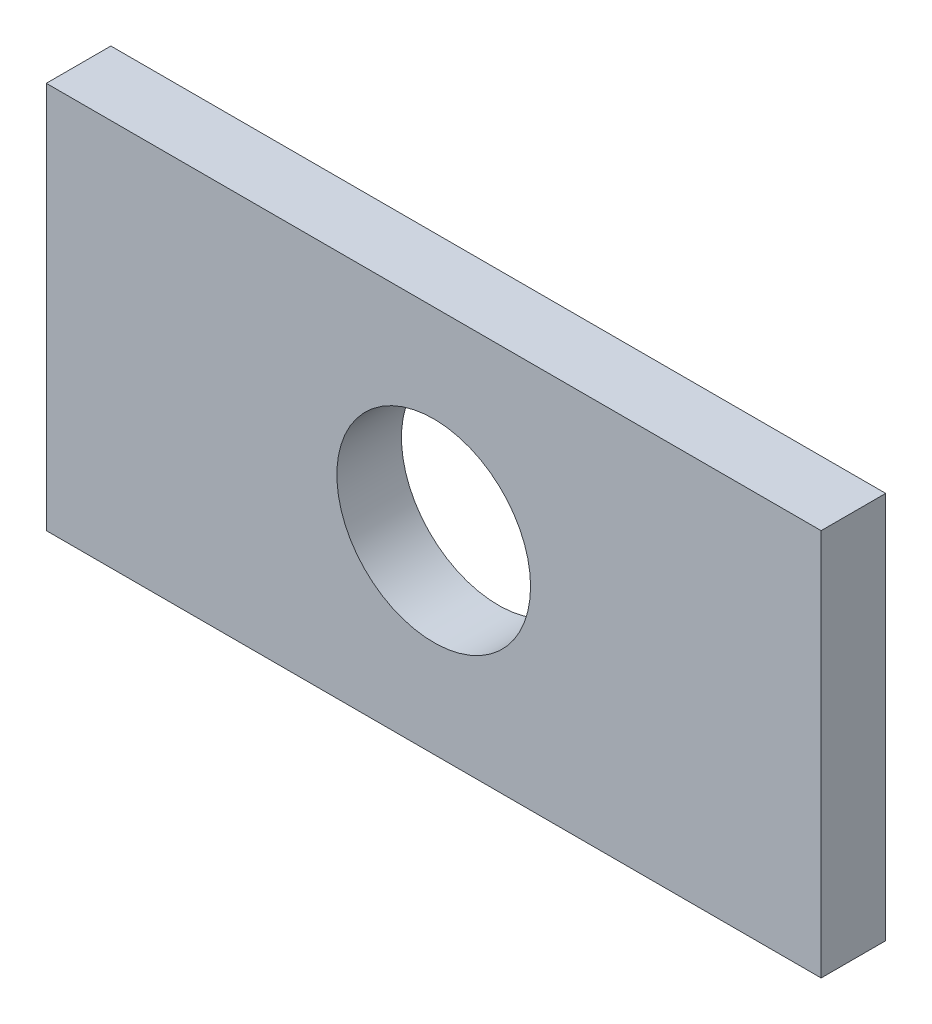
ISO-10303-21;
HEADER;
FILE_DESCRIPTION(('STEP AP214'),'2;1');
FILE_NAME('part.step','',(''),(''),'','','');
FILE_SCHEMA(('AUTOMOTIVE_DESIGN { 1 0 10303 214 1 1 1 1 }'));
ENDSEC;
DATA;
#1=APPLICATION_CONTEXT('core data for automotive mechanical design processes');
#2=APPLICATION_PROTOCOL_DEFINITION('international standard','automotive_design',2000,#1);
#3=PRODUCT_CONTEXT('',#1,'mechanical');
#4=PRODUCT('Part','Part','',(#3));
#5=PRODUCT_RELATED_PRODUCT_CATEGORY('part','',(#4));
#6=PRODUCT_DEFINITION_FORMATION('','',#4);
#7=PRODUCT_DEFINITION_CONTEXT('part definition',#1,'design');
#8=PRODUCT_DEFINITION('design','',#6,#7);
#9=PRODUCT_DEFINITION_SHAPE('','',#8);
#10=(LENGTH_UNIT() NAMED_UNIT(*) SI_UNIT(.MILLI.,.METRE.));
#11=(NAMED_UNIT(*) PLANE_ANGLE_UNIT() SI_UNIT($,.RADIAN.));
#12=(NAMED_UNIT(*) SI_UNIT($,.STERADIAN.) SOLID_ANGLE_UNIT());
#13=UNCERTAINTY_MEASURE_WITH_UNIT(LENGTH_MEASURE(1.E-05),#10,'distance_accuracy_value','');
#14=(GEOMETRIC_REPRESENTATION_CONTEXT(3) GLOBAL_UNCERTAINTY_ASSIGNED_CONTEXT((#13)) GLOBAL_UNIT_ASSIGNED_CONTEXT((#10,
#11,#12)) REPRESENTATION_CONTEXT('',''));
#15=CARTESIAN_POINT('',(0.,0.,0.));
#16=DIRECTION('',(0.,0.,1.));
#17=DIRECTION('',(1.,0.,0.));
#18=AXIS2_PLACEMENT_3D('',#15,#16,#17);
#19=CARTESIAN_POINT('',(-76.2,38.1,6.35));
#20=DIRECTION('',(1.,0.,0.));
#21=DIRECTION('',(0.,0.,-1.));
#22=AXIS2_PLACEMENT_3D('',#19,#20,#21);
#23=PLANE('',#22);
#24=DIRECTION('',(0.,-1.,0.));
#25=VECTOR('',#24,1.);
#26=CARTESIAN_POINT('',(-76.2,38.1,-6.35));
#27=LINE('',#26,#25);
#28=CARTESIAN_POINT('',(-76.2,38.1,-6.35));
#29=VERTEX_POINT('',#28);
#30=CARTESIAN_POINT('',(-76.2,-38.1,-6.35));
#31=VERTEX_POINT('',#30);
#32=EDGE_CURVE('E80',#29,#31,#27,.T.);
#33=ORIENTED_EDGE('',*,*,#32,.T.);
#34=DIRECTION('',(0.,0.,-1.));
#35=VECTOR('',#34,1.);
#36=CARTESIAN_POINT('',(-76.2,-38.1,6.35));
#37=LINE('',#36,#35);
#38=CARTESIAN_POINT('',(-76.2,-38.1,6.35));
#39=VERTEX_POINT('',#38);
#40=EDGE_CURVE('E11',#39,#31,#37,.T.);
#41=ORIENTED_EDGE('',*,*,#40,.F.);
#42=DIRECTION('',(0.,-1.,0.));
#43=VECTOR('',#42,1.);
#44=CARTESIAN_POINT('',(-76.2,38.1,6.35));
#45=LINE('',#44,#43);
#46=CARTESIAN_POINT('',(-76.2,38.1,6.35));
#47=VERTEX_POINT('',#46);
#48=EDGE_CURVE('E103',#47,#39,#45,.T.);
#49=ORIENTED_EDGE('',*,*,#48,.F.);
#50=DIRECTION('',(0.,0.,-1.));
#51=VECTOR('',#50,1.);
#52=CARTESIAN_POINT('',(-76.2,38.1,6.35));
#53=LINE('',#52,#51);
#54=EDGE_CURVE('E92',#47,#29,#53,.T.);
#55=ORIENTED_EDGE('',*,*,#54,.T.);
#56=EDGE_LOOP('',(#33,#41,#49,#55));
#57=FACE_BOUND('',#56,.T.);
#58=ADVANCED_FACE('F36',(#57),#23,.F.);
#59=CARTESIAN_POINT('',(-76.2,-38.1,6.35));
#60=DIRECTION('',(0.,1.,0.));
#61=DIRECTION('',(0.,0.,1.));
#62=AXIS2_PLACEMENT_3D('',#59,#60,#61);
#63=PLANE('',#62);
#64=DIRECTION('',(1.,0.,0.));
#65=VECTOR('',#64,1.);
#66=CARTESIAN_POINT('',(-76.2,-38.1,-6.35));
#67=LINE('',#66,#65);
#68=CARTESIAN_POINT('',(76.2,-38.1,-6.35));
#69=VERTEX_POINT('',#68);
#70=EDGE_CURVE('E76',#31,#69,#67,.T.);
#71=ORIENTED_EDGE('',*,*,#70,.T.);
#72=DIRECTION('',(0.,0.,-1.));
#73=VECTOR('',#72,1.);
#74=CARTESIAN_POINT('',(76.2,-38.1,6.35));
#75=LINE('',#74,#73);
#76=CARTESIAN_POINT('',(76.2,-38.1,6.35));
#77=VERTEX_POINT('',#76);
#78=EDGE_CURVE('E43',#77,#69,#75,.T.);
#79=ORIENTED_EDGE('',*,*,#78,.F.);
#80=DIRECTION('',(1.,0.,0.));
#81=VECTOR('',#80,1.);
#82=CARTESIAN_POINT('',(-76.2,-38.1,6.35));
#83=LINE('',#82,#81);
#84=EDGE_CURVE('E88',#39,#77,#83,.T.);
#85=ORIENTED_EDGE('',*,*,#84,.F.);
#86=ORIENTED_EDGE('',*,*,#40,.T.);
#87=EDGE_LOOP('',(#71,#79,#85,#86));
#88=FACE_BOUND('',#87,.T.);
#89=ADVANCED_FACE('F87',(#88),#63,.F.);
#90=CARTESIAN_POINT('',(76.2,38.1,6.35));
#91=DIRECTION('',(-1.,0.,0.));
#92=DIRECTION('',(0.,-1.,0.));
#93=AXIS2_PLACEMENT_3D('',#90,#91,#92);
#94=PLANE('',#93);
#95=DIRECTION('',(0.,1.,0.));
#96=VECTOR('',#95,1.);
#97=CARTESIAN_POINT('',(76.2,38.1,-6.35));
#98=LINE('',#97,#96);
#99=CARTESIAN_POINT('',(76.2,38.1,-6.35));
#100=VERTEX_POINT('',#99);
#101=EDGE_CURVE('E81',#69,#100,#98,.T.);
#102=ORIENTED_EDGE('',*,*,#101,.T.);
#103=DIRECTION('',(0.,0.,-1.));
#104=VECTOR('',#103,1.);
#105=CARTESIAN_POINT('',(76.2,38.1,6.35));
#106=LINE('',#105,#104);
#107=CARTESIAN_POINT('',(76.2,38.1,6.35));
#108=VERTEX_POINT('',#107);
#109=EDGE_CURVE('E109',#108,#100,#106,.T.);
#110=ORIENTED_EDGE('',*,*,#109,.F.);
#111=DIRECTION('',(0.,1.,0.));
#112=VECTOR('',#111,1.);
#113=CARTESIAN_POINT('',(76.2,38.1,6.35));
#114=LINE('',#113,#112);
#115=EDGE_CURVE('E55',#77,#108,#114,.T.);
#116=ORIENTED_EDGE('',*,*,#115,.F.);
#117=ORIENTED_EDGE('',*,*,#78,.T.);
#118=EDGE_LOOP('',(#102,#110,#116,#117));
#119=FACE_BOUND('',#118,.T.);
#120=ADVANCED_FACE('F112',(#119),#94,.F.);
#121=CARTESIAN_POINT('',(-76.2,38.1,6.35));
#122=DIRECTION('',(0.,-1.,0.));
#123=DIRECTION('',(0.,0.,-1.));
#124=AXIS2_PLACEMENT_3D('',#121,#122,#123);
#125=PLANE('',#124);
#126=DIRECTION('',(-1.,0.,0.));
#127=VECTOR('',#126,1.);
#128=CARTESIAN_POINT('',(-76.2,38.1,-6.35));
#129=LINE('',#128,#127);
#130=EDGE_CURVE('E101',#100,#29,#129,.T.);
#131=ORIENTED_EDGE('',*,*,#130,.T.);
#132=ORIENTED_EDGE('',*,*,#54,.F.);
#133=DIRECTION('',(-1.,0.,0.));
#134=VECTOR('',#133,1.);
#135=CARTESIAN_POINT('',(-76.2,38.1,6.35));
#136=LINE('',#135,#134);
#137=EDGE_CURVE('E50',#108,#47,#136,.T.);
#138=ORIENTED_EDGE('',*,*,#137,.F.);
#139=ORIENTED_EDGE('',*,*,#109,.T.);
#140=EDGE_LOOP('',(#131,#132,#138,#139));
#141=FACE_BOUND('',#140,.T.);
#142=ADVANCED_FACE('F114',(#141),#125,.F.);
#143=CARTESIAN_POINT('',(-76.2,-38.1,6.35));
#144=DIRECTION('',(0.,0.,1.));
#145=DIRECTION('',(1.,0.,0.));
#146=AXIS2_PLACEMENT_3D('',#143,#144,#145);
#147=PLANE('',#146);
#148=CARTESIAN_POINT('',(0.,0.,6.35));
#149=DIRECTION('',(0.,0.,1.));
#150=DIRECTION('',(1.,0.,0.));
#151=AXIS2_PLACEMENT_3D('',#148,#149,#150);
#152=CIRCLE('',#151,19.05);
#153=CARTESIAN_POINT('',(19.05,0.,6.35));
#154=VERTEX_POINT('',#153);
#155=EDGE_CURVE('E96',#154,#154,#152,.T.);
#156=ORIENTED_EDGE('',*,*,#155,.F.);
#157=EDGE_LOOP('',(#156));
#158=FACE_BOUND('',#157,.T.);
#159=ORIENTED_EDGE('',*,*,#48,.T.);
#160=ORIENTED_EDGE('',*,*,#84,.T.);
#161=ORIENTED_EDGE('',*,*,#115,.T.);
#162=ORIENTED_EDGE('',*,*,#137,.T.);
#163=EDGE_LOOP('',(#159,#160,#161,#162));
#164=FACE_BOUND('',#163,.T.);
#165=ADVANCED_FACE('F115',(#158,#164),#147,.T.);
#166=CARTESIAN_POINT('',(-76.2,-38.1,-6.35));
#167=DIRECTION('',(0.,0.,1.));
#168=DIRECTION('',(1.,0.,0.));
#169=AXIS2_PLACEMENT_3D('',#166,#167,#168);
#170=PLANE('',#169);
#171=CARTESIAN_POINT('',(0.,0.,-6.35));
#172=DIRECTION('',(0.,0.,1.));
#173=DIRECTION('',(1.,0.,0.));
#174=AXIS2_PLACEMENT_3D('',#171,#172,#173);
#175=CIRCLE('',#174,19.05);
#176=CARTESIAN_POINT('',(19.05,0.,-6.35));
#177=VERTEX_POINT('',#176);
#178=EDGE_CURVE('E93',#177,#177,#175,.T.);
#179=ORIENTED_EDGE('',*,*,#178,.T.);
#180=EDGE_LOOP('',(#179));
#181=FACE_BOUND('',#180,.T.);
#182=ORIENTED_EDGE('',*,*,#32,.F.);
#183=ORIENTED_EDGE('',*,*,#130,.F.);
#184=ORIENTED_EDGE('',*,*,#101,.F.);
#185=ORIENTED_EDGE('',*,*,#70,.F.);
#186=EDGE_LOOP('',(#182,#183,#184,#185));
#187=FACE_BOUND('',#186,.T.);
#188=ADVANCED_FACE('F77',(#181,#187),#170,.F.);
#189=CARTESIAN_POINT('',(0.,0.,-6.35));
#190=DIRECTION('',(0.,0.,1.));
#191=DIRECTION('',(1.,0.,0.));
#192=AXIS2_PLACEMENT_3D('',#189,#190,#191);
#193=CYLINDRICAL_SURFACE('',#192,19.05);
#194=ORIENTED_EDGE('',*,*,#178,.F.);
#195=EDGE_LOOP('',(#194));
#196=FACE_BOUND('',#195,.T.);
#197=ORIENTED_EDGE('',*,*,#155,.T.);
#198=EDGE_LOOP('',(#197));
#199=FACE_BOUND('',#198,.T.);
#200=ADVANCED_FACE('F123',(#196,#199),#193,.F.);
#201=CLOSED_SHELL('',(#58,#89,#120,#142,#165,#188,#200));
#202=MANIFOLD_SOLID_BREP('B2',#201);
#203=ADVANCED_BREP_SHAPE_REPRESENTATION('',(#18,#202),#14);
#204=SHAPE_DEFINITION_REPRESENTATION(#9,#203);
ENDSEC;
END-ISO-10303-21;
